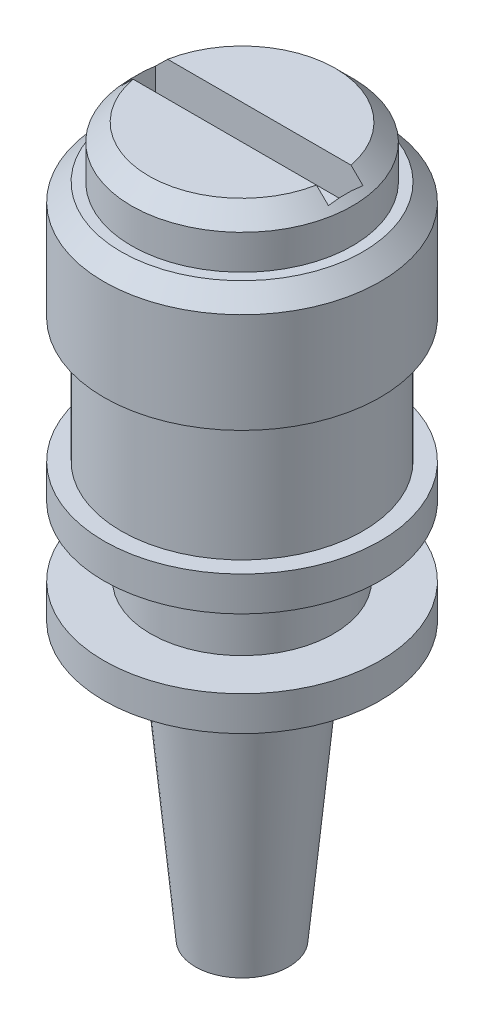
from build123d import *

# Parameters (mm, degrees)
CHANFREIN1_SIZE         = 0.5
ESQUISSE2_W             = 6
ESQUISSE2_H             = 1
ENL_V_MAT_EXTRU_1_DEPTH = 1


with BuildPart() as part:
    # Esquisse1 → Base-R_volution (revolve)
    with BuildSketch(Plane.XY, mode=Mode.PRIVATE) as base_r_volution_sk:
        Polygon((0, 0), (-1.35, 0), (-2, 7), (-2, 8), (-4, 8), (-4, 9), (-2.65, 9), (-2.65, 11), (-4, 11), (-4, 12), (-3.5, 12), (-3.5, 15.6), (-4, 15.6), (-4, 19), (-3.2, 19), (-3.2, 20.5), (0, 20.5), align=None)
    revolve(base_r_volution_sk.sketch.rotate(Axis((0, 80, 0), (0, -1, 0)), 270), axis=Axis((0, 80, 0), (0, -1, 0)))

    # Chanfrein1
    chanfrein1_edges = [part.edges().sort_by_distance(p)[0] for p in [
        (0, 19, -4),
        (0, 20.5, -3.2),
    ]]
    chamfer(chanfrein1_edges, length=CHANFREIN1_SIZE)

    # Esquisse2 → Enl_v. mat.-Extru.1 (cut)
    with BuildSketch(Plane(origin=(0, 20.5, 0), x_dir=(-1, 0, 0), z_dir=(0, 1, 0))):
        Rectangle(ESQUISSE2_W, ESQUISSE2_H)
    extrude(amount=-ENL_V_MAT_EXTRU_1_DEPTH, mode=Mode.SUBTRACT)


solid = part.part
